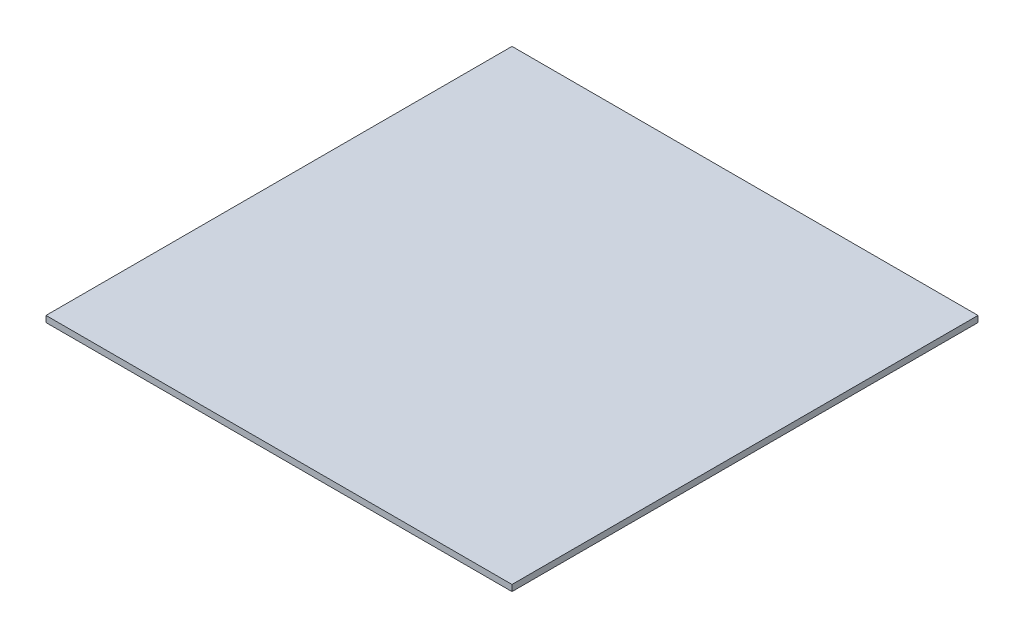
from build123d import *

# Parameters (mm, degrees)
SKETCH1_W           = 150
SKETCH1_H           = 150
BOSS_EXTRUDE1_DEPTH = 2


with BuildPart() as part:
    # Sketch1 → Boss-Extrude1 (new body)
    with BuildSketch(Plane(origin=(0, 0, 0), x_dir=(1, 0, 0), z_dir=(0, 1, 0))):
        Rectangle(SKETCH1_W, SKETCH1_H)
    extrude(amount=BOSS_EXTRUDE1_DEPTH)


solid = part.part
